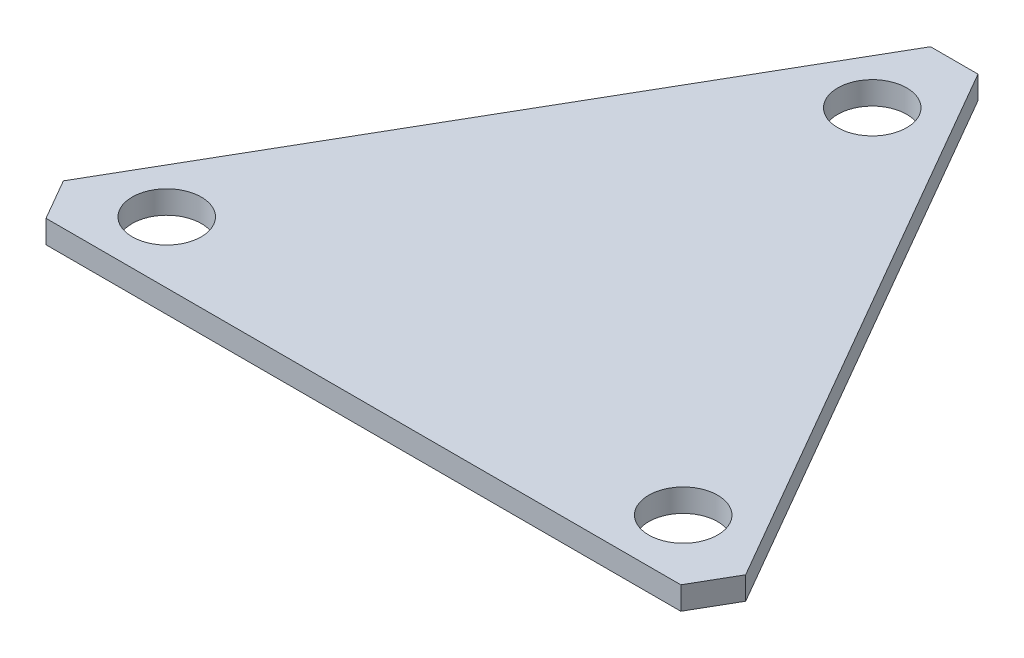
from build123d import *

# Parameters (mm, degrees)
EXTRUDE2_DEPTH     = 1.5875
SKETCH5_R          = 2.3876
CUT_EXTRUDE1_DEPTH = 36.389339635


with BuildPart() as part:
    # Sketch4 → Extrude2 (new body)
    with BuildSketch(Plane(origin=(0, 0, 0), x_dir=(1, 0, 0), z_dir=(0, 1, 0))):
        Polygon((-1.642518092, 26.314358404), (1.642518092, 26.314358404), (23.610161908, -11.734716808), (21.967643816, -14.579641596), (-21.967643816, -14.579641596), (-23.610161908, -11.734716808), align=None)
    extrude(amount=EXTRUDE2_DEPTH)

    # Sketch5 → Cut-Extrude1 (cut, through all)
    with BuildSketch(Plane(origin=(0, 1.5875, 0), x_dir=(1, 0, 0), z_dir=(0, 1, 0))):
        with Locations(Location((0, 20.6375, 0), (0, 0, 270))):
            Circle(SKETCH5_R)
        with Locations(Location((-17.872599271, -10.31875, 0), (0, 0, 270))):
            Circle(SKETCH5_R)
        with Locations(Location((17.872599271, -10.31875, 0), (0, 0, 270))):
            Circle(SKETCH5_R)
    extrude(amount=-CUT_EXTRUDE1_DEPTH, mode=Mode.SUBTRACT)


solid = part.part
